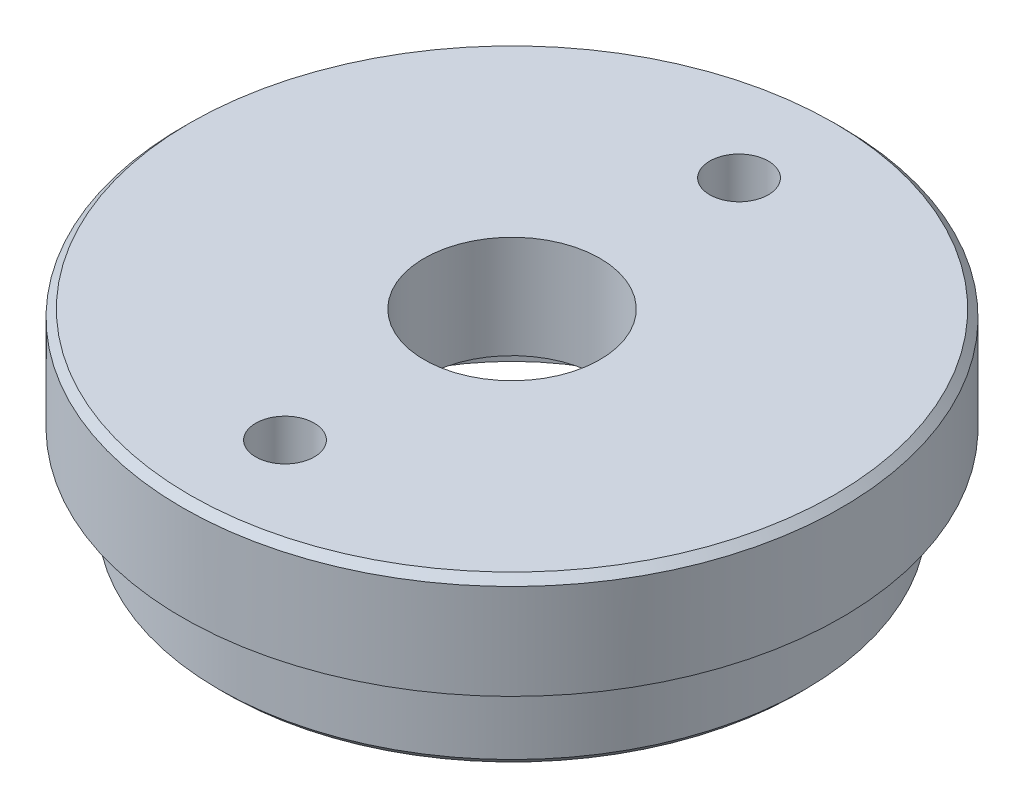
ISO-10303-21;
HEADER;
FILE_DESCRIPTION(('STEP AP214'),'2;1');
FILE_NAME('part.step','',(''),(''),'','','');
FILE_SCHEMA(('AUTOMOTIVE_DESIGN { 1 0 10303 214 1 1 1 1 }'));
ENDSEC;
DATA;
#1=APPLICATION_CONTEXT('core data for automotive mechanical design processes');
#2=APPLICATION_PROTOCOL_DEFINITION('international standard','automotive_design',2000,#1);
#3=PRODUCT_CONTEXT('',#1,'mechanical');
#4=PRODUCT('Part','Part','',(#3));
#5=PRODUCT_RELATED_PRODUCT_CATEGORY('part','',(#4));
#6=PRODUCT_DEFINITION_FORMATION('','',#4);
#7=PRODUCT_DEFINITION_CONTEXT('part definition',#1,'design');
#8=PRODUCT_DEFINITION('design','',#6,#7);
#9=PRODUCT_DEFINITION_SHAPE('','',#8);
#10=(LENGTH_UNIT() NAMED_UNIT(*) SI_UNIT(.MILLI.,.METRE.));
#11=(NAMED_UNIT(*) PLANE_ANGLE_UNIT() SI_UNIT($,.RADIAN.));
#12=(NAMED_UNIT(*) SI_UNIT($,.STERADIAN.) SOLID_ANGLE_UNIT());
#13=UNCERTAINTY_MEASURE_WITH_UNIT(LENGTH_MEASURE(1.E-05),#10,'distance_accuracy_value','');
#14=(GEOMETRIC_REPRESENTATION_CONTEXT(3) GLOBAL_UNCERTAINTY_ASSIGNED_CONTEXT((#13)) GLOBAL_UNIT_ASSIGNED_CONTEXT((#10,
#11,#12)) REPRESENTATION_CONTEXT('',''));
#15=CARTESIAN_POINT('',(0.,0.,0.));
#16=DIRECTION('',(0.,0.,1.));
#17=DIRECTION('',(1.,0.,0.));
#18=AXIS2_PLACEMENT_3D('',#15,#16,#17);
#19=CARTESIAN_POINT('',(0.,-39.,0.));
#20=DIRECTION('',(0.,-1.,0.));
#21=DIRECTION('',(0.,0.,-1.));
#22=AXIS2_PLACEMENT_3D('',#19,#20,#21);
#23=CYLINDRICAL_SURFACE('',#22,6.);
#24=CARTESIAN_POINT('',(0.,0.,0.));
#25=DIRECTION('',(0.,-1.,0.));
#26=DIRECTION('',(0.,0.,-1.));
#27=AXIS2_PLACEMENT_3D('',#24,#25,#26);
#28=CIRCLE('',#27,6.);
#29=CARTESIAN_POINT('',(0.,0.,-6.));
#30=VERTEX_POINT('',#29);
#31=EDGE_CURVE('E64',#30,#30,#28,.T.);
#32=ORIENTED_EDGE('',*,*,#31,.T.);
#33=EDGE_LOOP('',(#32));
#34=FACE_BOUND('',#33,.T.);
#35=CARTESIAN_POINT('',(0.,7.,0.));
#36=DIRECTION('',(0.,-1.,0.));
#37=DIRECTION('',(0.,0.,-1.));
#38=AXIS2_PLACEMENT_3D('',#35,#36,#37);
#39=CIRCLE('',#38,6.);
#40=CARTESIAN_POINT('',(0.,7.,-6.));
#41=VERTEX_POINT('',#40);
#42=EDGE_CURVE('E79',#41,#41,#39,.T.);
#43=ORIENTED_EDGE('',*,*,#42,.F.);
#44=EDGE_LOOP('',(#43));
#45=FACE_BOUND('',#44,.T.);
#46=ADVANCED_FACE('F31',(#34,#45),#23,.F.);
#47=CARTESIAN_POINT('',(6.,7.,0.));
#48=DIRECTION('',(0.,1.,0.));
#49=DIRECTION('',(0.,0.,1.));
#50=AXIS2_PLACEMENT_3D('',#47,#48,#49);
#51=PLANE('',#50);
#52=CARTESIAN_POINT('',(0.,7.,-15.5));
#53=DIRECTION('',(0.,1.,0.));
#54=DIRECTION('',(0.,0.,1.));
#55=AXIS2_PLACEMENT_3D('',#52,#53,#54);
#56=CIRCLE('',#55,2.);
#57=CARTESIAN_POINT('',(0.,7.,-13.5));
#58=VERTEX_POINT('',#57);
#59=EDGE_CURVE('E53',#58,#58,#56,.T.);
#60=ORIENTED_EDGE('',*,*,#59,.F.);
#61=EDGE_LOOP('',(#60));
#62=FACE_BOUND('',#61,.T.);
#63=CARTESIAN_POINT('',(0.,7.,15.5));
#64=DIRECTION('',(0.,1.,0.));
#65=DIRECTION('',(0.,0.,1.));
#66=AXIS2_PLACEMENT_3D('',#63,#64,#65);
#67=CIRCLE('',#66,2.);
#68=CARTESIAN_POINT('',(0.,7.,17.5));
#69=VERTEX_POINT('',#68);
#70=EDGE_CURVE('E61',#69,#69,#67,.T.);
#71=ORIENTED_EDGE('',*,*,#70,.F.);
#72=EDGE_LOOP('',(#71));
#73=FACE_BOUND('',#72,.T.);
#74=CARTESIAN_POINT('',(0.,7.,0.));
#75=DIRECTION('',(0.,1.,0.));
#76=DIRECTION('',(0.,0.,1.));
#77=AXIS2_PLACEMENT_3D('',#74,#75,#76);
#78=CIRCLE('',#77,22.);
#79=CARTESIAN_POINT('',(0.,7.,22.));
#80=VERTEX_POINT('',#79);
#81=EDGE_CURVE('E85',#80,#80,#78,.T.);
#82=ORIENTED_EDGE('',*,*,#81,.T.);
#83=EDGE_LOOP('',(#82));
#84=FACE_BOUND('',#83,.T.);
#85=ORIENTED_EDGE('',*,*,#42,.T.);
#86=EDGE_LOOP('',(#85));
#87=FACE_BOUND('',#86,.T.);
#88=ADVANCED_FACE('F111',(#62,#73,#84,#87),#51,.T.);
#89=CARTESIAN_POINT('',(0.,-39.,0.));
#90=DIRECTION('',(0.,-1.,0.));
#91=DIRECTION('',(0.,0.,-1.));
#92=AXIS2_PLACEMENT_3D('',#89,#90,#91);
#93=CYLINDRICAL_SURFACE('',#92,22.5);
#94=CARTESIAN_POINT('',(0.,6.49999999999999,0.));
#95=DIRECTION('',(0.,1.,0.));
#96=DIRECTION('',(0.,0.,1.));
#97=AXIS2_PLACEMENT_3D('',#94,#95,#96);
#98=CIRCLE('',#97,22.5);
#99=CARTESIAN_POINT('',(0.,6.49999999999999,22.5));
#100=VERTEX_POINT('',#99);
#101=EDGE_CURVE('E82',#100,#100,#98,.F.);
#102=ORIENTED_EDGE('',*,*,#101,.T.);
#103=EDGE_LOOP('',(#102));
#104=FACE_BOUND('',#103,.T.);
#105=CARTESIAN_POINT('',(0.,0.,0.));
#106=DIRECTION('',(0.,-1.,0.));
#107=DIRECTION('',(0.,0.,-1.));
#108=AXIS2_PLACEMENT_3D('',#105,#106,#107);
#109=CIRCLE('',#108,22.5);
#110=CARTESIAN_POINT('',(0.,0.,-22.5));
#111=VERTEX_POINT('',#110);
#112=EDGE_CURVE('E76',#111,#111,#109,.T.);
#113=ORIENTED_EDGE('',*,*,#112,.F.);
#114=EDGE_LOOP('',(#113));
#115=FACE_BOUND('',#114,.T.);
#116=ADVANCED_FACE('F116',(#104,#115),#93,.T.);
#117=CARTESIAN_POINT('',(22.5,0.,0.));
#118=DIRECTION('',(0.,-1.,0.));
#119=DIRECTION('',(0.,0.,-1.));
#120=AXIS2_PLACEMENT_3D('',#117,#118,#119);
#121=PLANE('',#120);
#122=ORIENTED_EDGE('',*,*,#112,.T.);
#123=EDGE_LOOP('',(#122));
#124=FACE_BOUND('',#123,.T.);
#125=CARTESIAN_POINT('',(0.,0.,0.));
#126=DIRECTION('',(0.,-1.,0.));
#127=DIRECTION('',(0.,0.,-1.));
#128=AXIS2_PLACEMENT_3D('',#125,#126,#127);
#129=CIRCLE('',#128,20.);
#130=CARTESIAN_POINT('',(0.,0.,-20.));
#131=VERTEX_POINT('',#130);
#132=EDGE_CURVE('E73',#131,#131,#129,.T.);
#133=ORIENTED_EDGE('',*,*,#132,.F.);
#134=EDGE_LOOP('',(#133));
#135=FACE_BOUND('',#134,.T.);
#136=ADVANCED_FACE('F138',(#124,#135),#121,.T.);
#137=CARTESIAN_POINT('',(0.,-39.,0.));
#138=DIRECTION('',(0.,-1.,0.));
#139=DIRECTION('',(0.,0.,-1.));
#140=AXIS2_PLACEMENT_3D('',#137,#138,#139);
#141=CYLINDRICAL_SURFACE('',#140,20.);
#142=CARTESIAN_POINT('',(0.,-5.5,0.));
#143=DIRECTION('',(0.,-1.,0.));
#144=DIRECTION('',(0.,0.,-1.));
#145=AXIS2_PLACEMENT_3D('',#142,#143,#144);
#146=CIRCLE('',#145,20.);
#147=CARTESIAN_POINT('',(0.,-5.5,-20.));
#148=VERTEX_POINT('',#147);
#149=EDGE_CURVE('E11',#148,#148,#146,.F.);
#150=ORIENTED_EDGE('',*,*,#149,.T.);
#151=EDGE_LOOP('',(#150));
#152=FACE_BOUND('',#151,.T.);
#153=ORIENTED_EDGE('',*,*,#132,.T.);
#154=EDGE_LOOP('',(#153));
#155=FACE_BOUND('',#154,.T.);
#156=ADVANCED_FACE('F135',(#152,#155),#141,.T.);
#157=CARTESIAN_POINT('',(20.,-6.,0.));
#158=DIRECTION('',(0.,-1.,0.));
#159=DIRECTION('',(0.,0.,-1.));
#160=AXIS2_PLACEMENT_3D('',#157,#158,#159);
#161=PLANE('',#160);
#162=CARTESIAN_POINT('',(0.,-6.,0.));
#163=DIRECTION('',(0.,-1.,0.));
#164=DIRECTION('',(0.,0.,-1.));
#165=AXIS2_PLACEMENT_3D('',#162,#163,#164);
#166=CIRCLE('',#165,19.5);
#167=CARTESIAN_POINT('',(0.,-6.,-19.5));
#168=VERTEX_POINT('',#167);
#169=EDGE_CURVE('E38',#168,#168,#166,.T.);
#170=ORIENTED_EDGE('',*,*,#169,.T.);
#171=EDGE_LOOP('',(#170));
#172=FACE_BOUND('',#171,.T.);
#173=CARTESIAN_POINT('',(0.,-6.,0.));
#174=DIRECTION('',(0.,-1.,0.));
#175=DIRECTION('',(0.,0.,-1.));
#176=AXIS2_PLACEMENT_3D('',#173,#174,#175);
#177=CIRCLE('',#176,14.);
#178=CARTESIAN_POINT('',(0.,-6.,-14.));
#179=VERTEX_POINT('',#178);
#180=EDGE_CURVE('E70',#179,#179,#177,.T.);
#181=ORIENTED_EDGE('',*,*,#180,.F.);
#182=EDGE_LOOP('',(#181));
#183=FACE_BOUND('',#182,.T.);
#184=ADVANCED_FACE('F90',(#172,#183),#161,.T.);
#185=CARTESIAN_POINT('',(0.,-39.,0.));
#186=DIRECTION('',(0.,-1.,0.));
#187=DIRECTION('',(0.,0.,-1.));
#188=AXIS2_PLACEMENT_3D('',#185,#186,#187);
#189=CYLINDRICAL_SURFACE('',#188,14.);
#190=ORIENTED_EDGE('',*,*,#180,.T.);
#191=EDGE_LOOP('',(#190));
#192=FACE_BOUND('',#191,.T.);
#193=CARTESIAN_POINT('',(0.,0.,0.));
#194=DIRECTION('',(0.,-1.,0.));
#195=DIRECTION('',(0.,0.,-1.));
#196=AXIS2_PLACEMENT_3D('',#193,#194,#195);
#197=CIRCLE('',#196,14.);
#198=CARTESIAN_POINT('',(0.,0.,-14.));
#199=VERTEX_POINT('',#198);
#200=EDGE_CURVE('E67',#199,#199,#197,.T.);
#201=ORIENTED_EDGE('',*,*,#200,.F.);
#202=EDGE_LOOP('',(#201));
#203=FACE_BOUND('',#202,.T.);
#204=ADVANCED_FACE('F124',(#192,#203),#189,.F.);
#205=CARTESIAN_POINT('',(14.,0.,0.));
#206=DIRECTION('',(0.,-1.,0.));
#207=DIRECTION('',(0.,0.,-1.));
#208=AXIS2_PLACEMENT_3D('',#205,#206,#207);
#209=PLANE('',#208);
#210=ORIENTED_EDGE('',*,*,#200,.T.);
#211=EDGE_LOOP('',(#210));
#212=FACE_BOUND('',#211,.T.);
#213=ORIENTED_EDGE('',*,*,#31,.F.);
#214=EDGE_LOOP('',(#213));
#215=FACE_BOUND('',#214,.T.);
#216=ADVANCED_FACE('F106',(#212,#215),#209,.T.);
#217=CARTESIAN_POINT('',(0.,6.49999999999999,0.));
#218=DIRECTION('',(0.,-1.,0.));
#219=DIRECTION('',(0.,0.,-1.));
#220=AXIS2_PLACEMENT_3D('',#217,#218,#219);
#221=CONICAL_SURFACE('',#220,22.5,0.785398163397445);
#222=ORIENTED_EDGE('',*,*,#81,.F.);
#223=EDGE_LOOP('',(#222));
#224=FACE_BOUND('',#223,.T.);
#225=ORIENTED_EDGE('',*,*,#101,.F.);
#226=EDGE_LOOP('',(#225));
#227=FACE_BOUND('',#226,.T.);
#228=ADVANCED_FACE('F96',(#224,#227),#221,.T.);
#229=CARTESIAN_POINT('',(0.,-6.,0.));
#230=DIRECTION('',(0.,1.,0.));
#231=DIRECTION('',(0.,0.,1.));
#232=AXIS2_PLACEMENT_3D('',#229,#230,#231);
#233=CONICAL_SURFACE('',#232,19.5,0.785398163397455);
#234=ORIENTED_EDGE('',*,*,#149,.F.);
#235=EDGE_LOOP('',(#234));
#236=FACE_BOUND('',#235,.T.);
#237=ORIENTED_EDGE('',*,*,#169,.F.);
#238=EDGE_LOOP('',(#237));
#239=FACE_BOUND('',#238,.T.);
#240=ADVANCED_FACE('F93',(#236,#239),#233,.T.);
#241=CARTESIAN_POINT('',(0.,7.,15.5));
#242=DIRECTION('',(0.,1.,0.));
#243=DIRECTION('',(0.,0.,1.));
#244=AXIS2_PLACEMENT_3D('',#241,#242,#243);
#245=CYLINDRICAL_SURFACE('',#244,2.);
#246=CARTESIAN_POINT('',(0.,3.,15.5));
#247=DIRECTION('',(0.,1.,0.));
#248=DIRECTION('',(0.,0.,1.));
#249=AXIS2_PLACEMENT_3D('',#246,#247,#248);
#250=CIRCLE('',#249,2.);
#251=CARTESIAN_POINT('',(0.,3.,17.5));
#252=VERTEX_POINT('',#251);
#253=EDGE_CURVE('E56',#252,#252,#250,.T.);
#254=ORIENTED_EDGE('',*,*,#253,.F.);
#255=EDGE_LOOP('',(#254));
#256=FACE_BOUND('',#255,.T.);
#257=ORIENTED_EDGE('',*,*,#70,.T.);
#258=EDGE_LOOP('',(#257));
#259=FACE_BOUND('',#258,.T.);
#260=ADVANCED_FACE('F95',(#256,#259),#245,.F.);
#261=CARTESIAN_POINT('',(0.,3.,15.5));
#262=DIRECTION('',(0.,1.,0.));
#263=DIRECTION('',(0.,0.,1.));
#264=AXIS2_PLACEMENT_3D('',#261,#262,#263);
#265=CONICAL_SURFACE('',#264,2.,1.02974425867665);
#266=CARTESIAN_POINT('',(0.,1.79827876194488,15.5));
#267=VERTEX_POINT('',#266);
#268=VERTEX_LOOP('',#267);
#269=FACE_BOUND('',#268,.T.);
#270=ORIENTED_EDGE('',*,*,#253,.T.);
#271=EDGE_LOOP('',(#270));
#272=FACE_BOUND('',#271,.T.);
#273=ADVANCED_FACE('F103',(#269,#272),#265,.F.);
#274=CARTESIAN_POINT('',(0.,7.,-15.5));
#275=DIRECTION('',(0.,1.,0.));
#276=DIRECTION('',(0.,0.,1.));
#277=AXIS2_PLACEMENT_3D('',#274,#275,#276);
#278=CYLINDRICAL_SURFACE('',#277,2.);
#279=CARTESIAN_POINT('',(0.,3.,-15.5));
#280=DIRECTION('',(0.,1.,0.));
#281=DIRECTION('',(0.,0.,1.));
#282=AXIS2_PLACEMENT_3D('',#279,#280,#281);
#283=CIRCLE('',#282,2.);
#284=CARTESIAN_POINT('',(0.,3.,-13.5));
#285=VERTEX_POINT('',#284);
#286=EDGE_CURVE('E51',#285,#285,#283,.T.);
#287=ORIENTED_EDGE('',*,*,#286,.F.);
#288=EDGE_LOOP('',(#287));
#289=FACE_BOUND('',#288,.T.);
#290=ORIENTED_EDGE('',*,*,#59,.T.);
#291=EDGE_LOOP('',(#290));
#292=FACE_BOUND('',#291,.T.);
#293=ADVANCED_FACE('F47',(#289,#292),#278,.F.);
#294=CARTESIAN_POINT('',(0.,3.,-15.5));
#295=DIRECTION('',(0.,1.,0.));
#296=DIRECTION('',(0.,0.,1.));
#297=AXIS2_PLACEMENT_3D('',#294,#295,#296);
#298=CONICAL_SURFACE('',#297,2.,1.02974425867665);
#299=CARTESIAN_POINT('',(0.,1.79827876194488,-15.5));
#300=VERTEX_POINT('',#299);
#301=VERTEX_LOOP('',#300);
#302=FACE_BOUND('',#301,.T.);
#303=ORIENTED_EDGE('',*,*,#286,.T.);
#304=EDGE_LOOP('',(#303));
#305=FACE_BOUND('',#304,.T.);
#306=ADVANCED_FACE('F44',(#302,#305),#298,.F.);
#307=CLOSED_SHELL('',(#46,#88,#116,#136,#156,#184,#204,#216,#228,#240,#260,#273,#293,#306));
#308=MANIFOLD_SOLID_BREP('B2',#307);
#309=ADVANCED_BREP_SHAPE_REPRESENTATION('',(#18,#308),#14);
#310=SHAPE_DEFINITION_REPRESENTATION(#9,#309);
ENDSEC;
END-ISO-10303-21;
